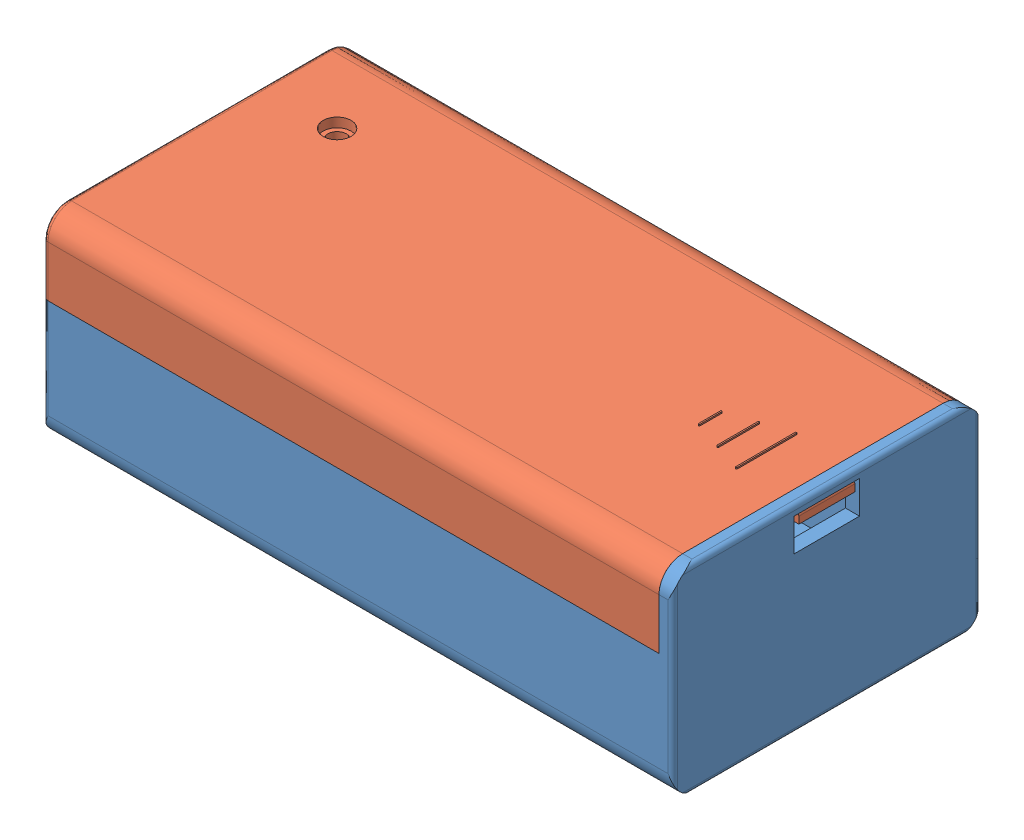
SolidWorks assembly 9v_and_housing_11_19_20.SLDASM, configuration Default (file format 13000). Lengths in mm.
Overall size (67.49 21.36 32.99).
2 component instances, 2 part files, 4 mates.
Components (placement in the parent):
- 9v_holder_bottom_11_19_20-2: 9v_holder_bottom_11_19_20.SLDPRT [Default] at origin size (67.49 21.21 32.99)
- Top_9v_holder_11_19_20-1: Top_9v_holder_11_19_20.SLDPRT [Default] at (-0.75 6.6045 0) size (67.49 13.15 32.99)
Mates (geometry in assembly coordinates):
- Coincident3: coincident anti-aligned: plane of 9v_holder_bottom_11_19_20-2 through (-33.2439 2.6045 15.9973) normal (0 1 0); plane of Top_9v_holder_11_19_20-1 through (-33.7439 2.6045 16.4973) normal (0 -1 0)
- Parallel2: parallel aligned: plane of 9v_holder_bottom_11_19_20-2 through (-34.2439 3.6045 -16.4973) normal (0 1 0); plane of Top_9v_holder_11_19_20-1 through (-33.2439 10.6045 16.4973) normal (0 1 0)
- Coincident6: coincident aligned: plane of 9v_holder_bottom_11_19_20-2 through (33.2439 10.1045 -16.4973) normal (0 0 -1); plane of Top_9v_holder_11_19_20-1 through (-33.2439 10.1045 -16.4973) normal (0 0 -1)
- Coincident7: coincident anti-aligned: plane of 9v_holder_bottom_11_19_20-2 through (32.2439 10.6045 -16.4973) normal (-1 0 0); plane of Top_9v_holder_11_19_20-1 through (32.2439 10.6045 16.4973) normal (1 0 0)
